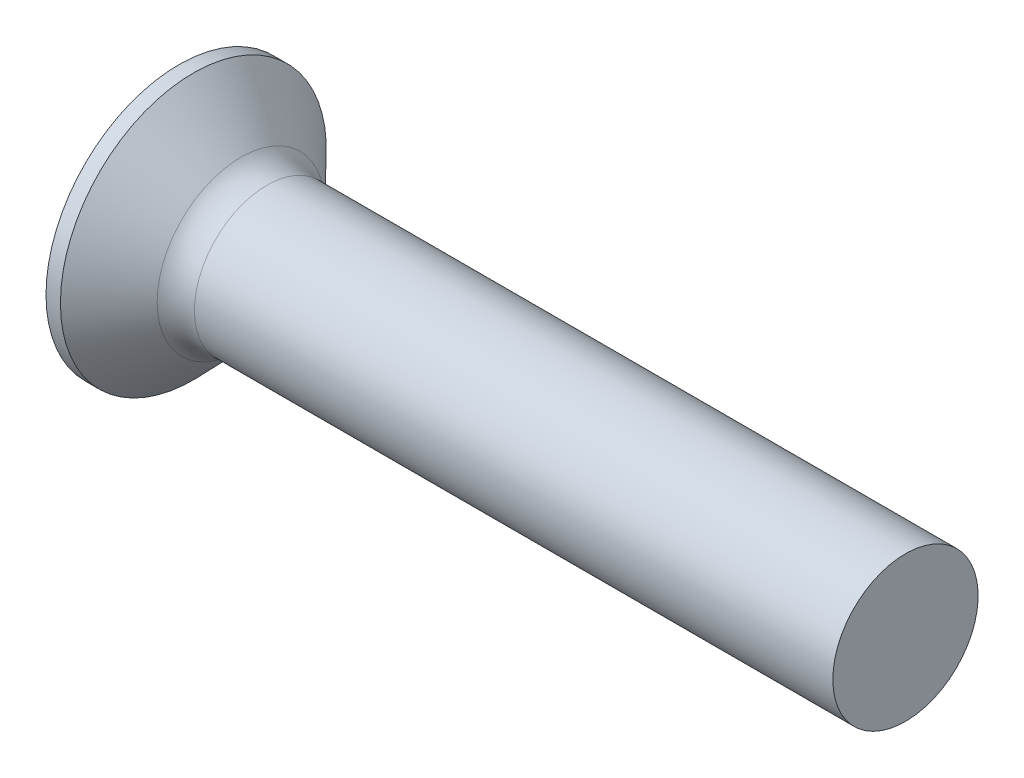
from build123d import *

# Parameters (mm, degrees)
FILLET1_R    = 2.5
RECPAT_COUNT = 2
RECPAT_ANGLE = 90


with BuildPart() as part:
    # BodySke → Base-Revolve (revolve)
    with BuildSketch(Plane.XY, mode=Mode.PRIVATE) as base_revolve_sk:
        Polygon((0, 0), (0, 9.15), (0.992391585, 9.15), (5, 5), (50, 5), (50, 0), align=None)
    revolve(base_revolve_sk.sketch.rotate(Axis((-6.35, 0, 0), (1, 0, 0)), 90), axis=Axis((-6.35, 0, 0), (1, 0, 0)))

    # Fillet1
    fillet1_edges = [part.edges().sort_by_distance(p)[0] for p in [
        (5, 0, -5),
    ]]
    fillet(fillet1_edges, radius=FILLET1_R)

    # Sketch3 → Recess section 0
    with BuildSketch(Plane.ZY):
        with BuildLine():
            Line((-1.08, 4.9), (1.08, 4.9))
            Line((1.08, 4.9), (1.08, -4.9))
            Line((1.08, -4.9), (-1.08, -4.9))
            Line((-1.08, -4.9), (-1.08, 4.9))
        make_face()
    # Sketch4 → Recess section 1
    with BuildSketch(Plane.ZY.offset(-5.64)):
        with BuildLine():
            Line((-1.08, 2.088000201), (1.08, 2.088000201))
            Line((1.08, 2.088000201), (1.08, -2.088000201))
            Line((1.08, -2.088000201), (-1.08, -2.088000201))
            Line((-1.08, -2.088000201), (-1.08, 2.088000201))
        make_face()
    recess = loft(mode=Mode.SUBTRACT)

    # RecPat: Recess ×2 about axis
    recpat_axis = Axis((0, 0, 0), (1, 0, 0))
    for i in range(1, RECPAT_COUNT):
        add(recess.rotate(recpat_axis, i * RECPAT_ANGLE / (RECPAT_COUNT - 1)), mode=Mode.SUBTRACT)

    # RecCorSke → RecessCore (revolve, cut)
    with BuildSketch(Plane.XY, mode=Mode.PRIVATE) as recesscore_sk:
        Polygon((0, 0), (0, 2.324887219), (5.64, 1.9305), (6.267257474, 0), align=None)
    revolve(recesscore_sk.sketch.rotate(Axis((-3.175, 0, 0), (1, 0, 0)), 90), axis=Axis((-3.175, 0, 0), (1, 0, 0)), mode=Mode.SUBTRACT)


solid = part.part
